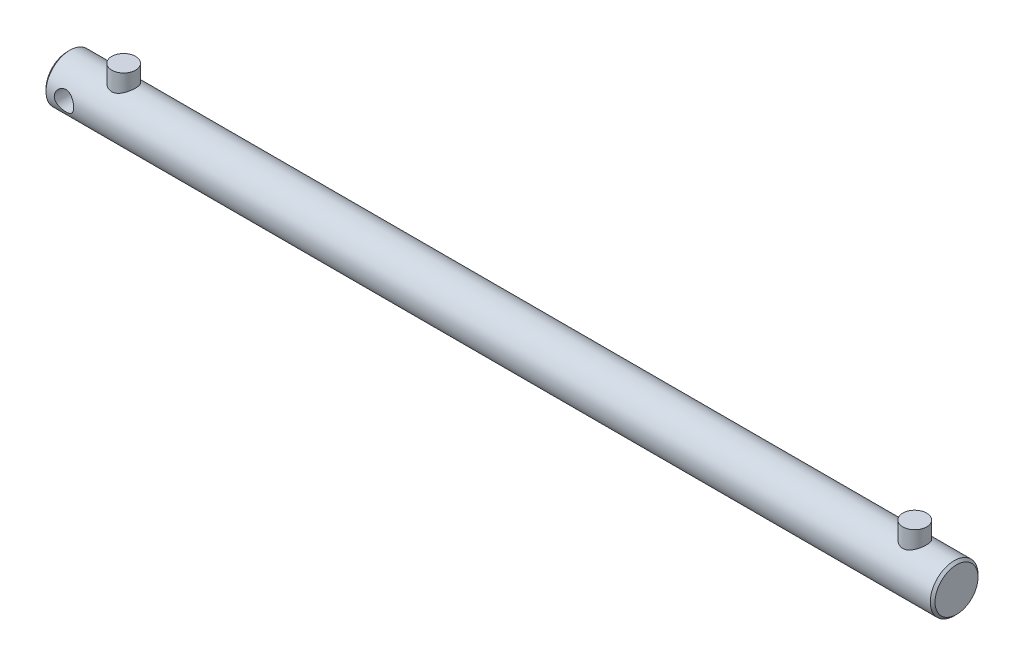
from build123d import *

# Parameters (mm, degrees)
ESQUISSE1_W                  = 744
ESQUISSE1_H                  = 20
CHANFREIN1_SIZE              = 2
ENL_V_MAT_EXTRU_1_DEPTH      = 374.073719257
ENL_V_MAT_EXTRU_1_DEPTH_BACK = 374.073719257
ESQUISSE3_R                  = 8.1
ESQUISSE5_R                  = 10
EXTRUSION2_DEPTH             = 33


with BuildPart() as part:
    # Esquisse1 → R_volution1 (revolve)
    with BuildSketch(Plane.XY, mode=Mode.PRIVATE) as r_volution1_sk:
        with Locations((0, 10)):
            Rectangle(ESQUISSE1_W, ESQUISSE1_H)
    revolve(r_volution1_sk.sketch.rotate(Axis((-372, 0, 0), (1, 0, 0)), 90), axis=Axis((-372, 0, 0), (1, 0, 0)))

    # Chanfrein1
    chanfrein1_edges = [part.edges().sort_by_distance(p)[0] for p in [
        (372, 0, -20),
        (-372, 0, -20),
    ]]
    chamfer(chanfrein1_edges, length=CHANFREIN1_SIZE)

    # Esquisse3 → Enl_v. mat.-Extru.1 (cut, two sides: drawn at the far end of the back side and taken through both)
    with BuildSketch(Plane.XY.offset(-ENL_V_MAT_EXTRU_1_DEPTH_BACK)):
        with Locations((-355, 0)):
            Circle(ESQUISSE3_R)
    extrude(amount=ENL_V_MAT_EXTRU_1_DEPTH + ENL_V_MAT_EXTRU_1_DEPTH_BACK, mode=Mode.SUBTRACT)

    # Esquisse5 → Extrusion2 (add)
    with BuildSketch(Plane(origin=(0, 0, 0), x_dir=(1, 0, 0), z_dir=(0, 1, 0))):
        with Locations(Location((-325, 0, 0), (0, 0, 90))):
            Circle(ESQUISSE5_R)
        with Locations(Location((337, 0, 0), (0, 0, 90))):
            Circle(ESQUISSE5_R)
    extrude(amount=EXTRUSION2_DEPTH)


solid = part.part
